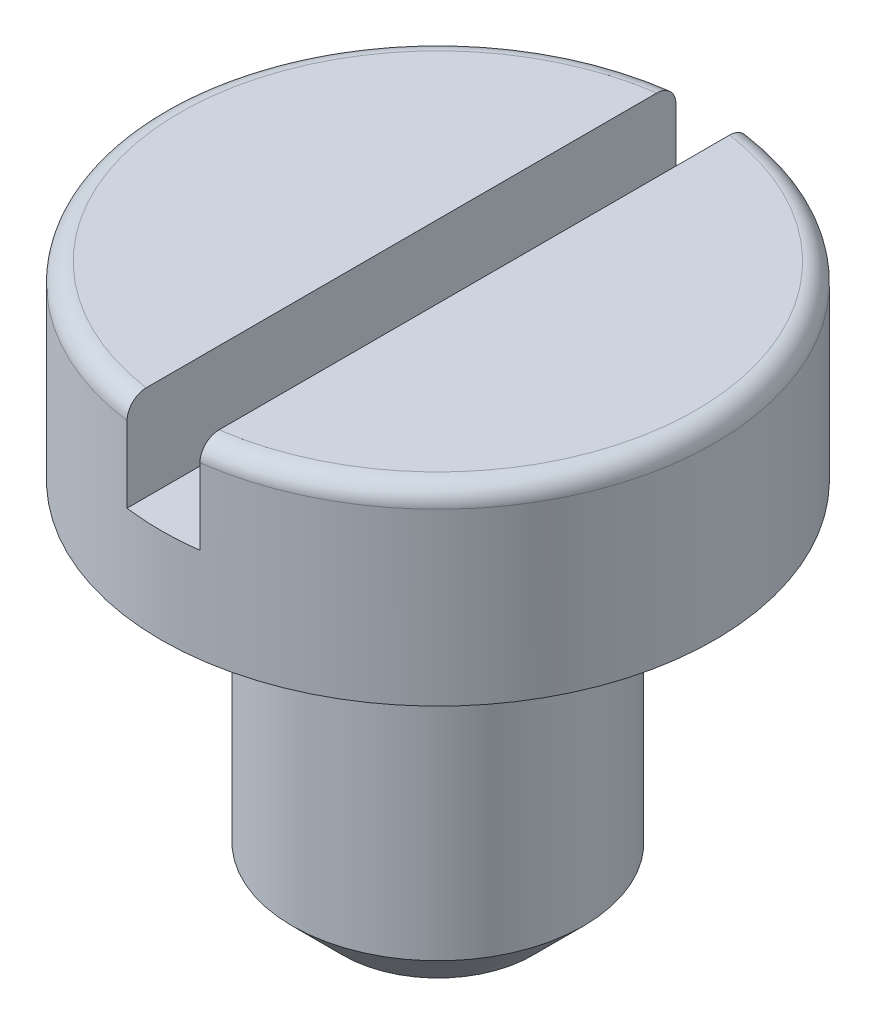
ISO-10303-21;
HEADER;
FILE_DESCRIPTION(('STEP AP214'),'2;1');
FILE_NAME('part.step','',(''),(''),'','','');
FILE_SCHEMA(('AUTOMOTIVE_DESIGN { 1 0 10303 214 1 1 1 1 }'));
ENDSEC;
DATA;
#1=APPLICATION_CONTEXT('core data for automotive mechanical design processes');
#2=APPLICATION_PROTOCOL_DEFINITION('international standard','automotive_design',2000,#1);
#3=PRODUCT_CONTEXT('',#1,'mechanical');
#4=PRODUCT('Part','Part','',(#3));
#5=PRODUCT_RELATED_PRODUCT_CATEGORY('part','',(#4));
#6=PRODUCT_DEFINITION_FORMATION('','',#4);
#7=PRODUCT_DEFINITION_CONTEXT('part definition',#1,'design');
#8=PRODUCT_DEFINITION('design','',#6,#7);
#9=PRODUCT_DEFINITION_SHAPE('','',#8);
#10=(LENGTH_UNIT() NAMED_UNIT(*) SI_UNIT(.MILLI.,.METRE.));
#11=(NAMED_UNIT(*) PLANE_ANGLE_UNIT() SI_UNIT($,.RADIAN.));
#12=(NAMED_UNIT(*) SI_UNIT($,.STERADIAN.) SOLID_ANGLE_UNIT());
#13=UNCERTAINTY_MEASURE_WITH_UNIT(LENGTH_MEASURE(1.E-05),#10,'distance_accuracy_value','');
#14=(GEOMETRIC_REPRESENTATION_CONTEXT(3) GLOBAL_UNCERTAINTY_ASSIGNED_CONTEXT((#13)) GLOBAL_UNIT_ASSIGNED_CONTEXT((#10,
#11,#12)) REPRESENTATION_CONTEXT('',''));
#15=CARTESIAN_POINT('',(0.,0.,0.));
#16=DIRECTION('',(0.,0.,1.));
#17=DIRECTION('',(1.,0.,0.));
#18=AXIS2_PLACEMENT_3D('',#15,#16,#17);
#19=CARTESIAN_POINT('',(0.,1.3,0.));
#20=DIRECTION('',(0.,-1.,0.));
#21=DIRECTION('',(0.,0.,-1.));
#22=AXIS2_PLACEMENT_3D('',#19,#20,#21);
#23=PLANE('',#22);
#24=CARTESIAN_POINT('',(0.,1.3,0.));
#25=DIRECTION('',(0.,1.,0.));
#26=DIRECTION('',(0.,0.,1.));
#27=AXIS2_PLACEMENT_3D('',#24,#25,#26);
#28=CIRCLE('',#27,1.77);
#29=CARTESIAN_POINT('',(-0.25,1.3,-1.75225568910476));
#30=VERTEX_POINT('',#29);
#31=CARTESIAN_POINT('',(-0.25,1.3,1.75225568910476));
#32=VERTEX_POINT('',#31);
#33=EDGE_CURVE('E96',#30,#32,#28,.T.);
#34=ORIENTED_EDGE('',*,*,#33,.T.);
#35=DIRECTION('',(0.,0.,1.));
#36=VECTOR('',#35,1.);
#37=CARTESIAN_POINT('',(-0.25,1.3,-1.9));
#38=LINE('',#37,#36);
#39=EDGE_CURVE('E87',#30,#32,#38,.T.);
#40=ORIENTED_EDGE('',*,*,#39,.F.);
#41=EDGE_LOOP('',(#34,#40));
#42=FACE_BOUND('',#41,.T.);
#43=ADVANCED_FACE('F33',(#42),#23,.F.);
#44=CARTESIAN_POINT('',(0.,1.17,0.));
#45=DIRECTION('',(0.,1.,0.));
#46=DIRECTION('',(0.,0.,1.));
#47=AXIS2_PLACEMENT_3D('',#44,#45,#46);
#48=TOROIDAL_SURFACE('',#47,1.77,0.13);
#49=ORIENTED_EDGE('',*,*,#33,.F.);
#50=CARTESIAN_POINT('',(-0.25,1.24765306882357,-1.85751121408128));
#51=CARTESIAN_POINT('',(-0.25,1.24184344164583,-1.8618768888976));
#52=CARTESIAN_POINT('',(-0.25,1.23566300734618,-1.8657574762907));
#53=CARTESIAN_POINT('',(-0.25,1.22273394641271,-1.87243030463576));
#54=CARTESIAN_POINT('',(-0.25,1.21598469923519,-1.87522133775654));
#55=CARTESIAN_POINT('',(-0.25,1.2021137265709,-1.8796278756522));
#56=CARTESIAN_POINT('',(-0.25,1.19499208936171,-1.88124365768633));
#57=CARTESIAN_POINT('',(-0.25,1.1805801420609,-1.88325159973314));
#58=CARTESIAN_POINT('',(-0.25,1.17328987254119,-1.88364405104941));
#59=CARTESIAN_POINT('',(-0.25,1.15877115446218,-1.88319529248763));
#60=CARTESIAN_POINT('',(-0.25,1.15154258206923,-1.88235808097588));
#61=CARTESIAN_POINT('',(-0.25,1.13732842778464,-1.87948214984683));
#62=CARTESIAN_POINT('',(-0.25,1.1303428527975,-1.87744339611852));
#63=CARTESIAN_POINT('',(-0.25,1.11681018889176,-1.87222403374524));
#64=CARTESIAN_POINT('',(-0.25,1.11026321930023,-1.86904311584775));
#65=CARTESIAN_POINT('',(-0.25,1.09779247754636,-1.86163282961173));
#66=CARTESIAN_POINT('',(-0.25,1.09186871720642,-1.85740344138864));
#67=CARTESIAN_POINT('',(-0.25,1.0807778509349,-1.84799363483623));
#68=CARTESIAN_POINT('',(-0.25,1.07561492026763,-1.84280829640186));
#69=CARTESIAN_POINT('',(-0.25,1.06622404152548,-1.83165084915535));
#70=CARTESIAN_POINT('',(-0.25,1.06199613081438,-1.82567870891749));
#71=CARTESIAN_POINT('',(-0.25,1.05455679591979,-1.81306325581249));
#72=CARTESIAN_POINT('',(-0.25,1.05135429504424,-1.80641468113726));
#73=CARTESIAN_POINT('',(-0.25,1.04610013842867,-1.79267739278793));
#74=CARTESIAN_POINT('',(-0.25,1.04404853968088,-1.78558865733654));
#75=CARTESIAN_POINT('',(-0.25,1.04113716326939,-1.77110723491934));
#76=CARTESIAN_POINT('',(-0.25,1.04028774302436,-1.76371246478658));
#77=CARTESIAN_POINT('',(-0.25,1.03983551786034,-1.74888481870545));
#78=CARTESIAN_POINT('',(-0.25,1.04023275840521,-1.74145194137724));
#79=CARTESIAN_POINT('',(-0.25,1.0422677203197,-1.72671918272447));
#80=CARTESIAN_POINT('',(-0.25,1.04391174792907,-1.71942017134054));
#81=CARTESIAN_POINT('',(-0.25,1.0484030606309,-1.70520204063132));
#82=CARTESIAN_POINT('',(-0.25,1.05125035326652,-1.69828292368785));
#83=CARTESIAN_POINT('',(-0.25,1.05806707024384,-1.68503083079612));
#84=CARTESIAN_POINT('',(-0.25,1.06203525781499,-1.67869721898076));
#85=CARTESIAN_POINT('',(-0.25,1.07098623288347,-1.66679261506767));
#86=CARTESIAN_POINT('',(-0.25,1.07596898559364,-1.66122159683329));
#87=CARTESIAN_POINT('',(-0.25,1.08676870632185,-1.65104713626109));
#88=CARTESIAN_POINT('',(-0.25,1.09257906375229,-1.64643667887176));
#89=CARTESIAN_POINT('',(-0.25,1.104898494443,-1.6382695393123));
#90=CARTESIAN_POINT('',(-0.25,1.11140752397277,-1.63471279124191));
#91=CARTESIAN_POINT('',(-0.25,1.12486287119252,-1.62879525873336));
#92=CARTESIAN_POINT('',(-0.25,1.13180360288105,-1.6264217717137));
#93=CARTESIAN_POINT('',(-0.25,1.14598688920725,-1.62288559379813));
#94=CARTESIAN_POINT('',(-0.25,1.15322942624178,-1.62172283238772));
#95=CARTESIAN_POINT('',(-0.25,1.1677414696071,-1.62064893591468));
#96=CARTESIAN_POINT('',(-0.25,1.17501015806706,-1.62072672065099));
#97=CARTESIAN_POINT('',(-0.25,1.18943061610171,-1.62210442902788));
#98=CARTESIAN_POINT('',(-0.25,1.19658238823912,-1.6234043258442));
#99=CARTESIAN_POINT('',(-0.25,1.21055111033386,-1.62718250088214));
#100=CARTESIAN_POINT('',(-0.25,1.2173687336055,-1.62965829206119));
#101=CARTESIAN_POINT('',(-0.25,1.23049498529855,-1.63571289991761));
#102=CARTESIAN_POINT('',(-0.25,1.23680360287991,-1.6392917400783));
#103=CARTESIAN_POINT('',(-0.25,1.24877339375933,-1.6474708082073));
#104=CARTESIAN_POINT('',(-0.25,1.25443060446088,-1.6520768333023));
#105=CARTESIAN_POINT('',(-0.25,1.26490155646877,-1.66216425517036));
#106=CARTESIAN_POINT('',(-0.25,1.2697152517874,-1.66764569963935));
#107=CARTESIAN_POINT('',(-0.25,1.27841666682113,-1.6793899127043));
#108=CARTESIAN_POINT('',(-0.25,1.28229410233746,-1.68566030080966));
#109=CARTESIAN_POINT('',(-0.25,1.28895337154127,-1.69875810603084));
#110=CARTESIAN_POINT('',(-0.25,1.29173514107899,-1.70558555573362));
#111=CARTESIAN_POINT('',(-0.25,1.29615144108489,-1.71967698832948));
#112=CARTESIAN_POINT('',(-0.25,1.29777424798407,-1.72694464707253));
#113=CARTESIAN_POINT('',(-0.25,1.29978331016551,-1.74164873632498));
#114=CARTESIAN_POINT('',(-0.25,1.30016956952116,-1.74908516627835));
#115=CARTESIAN_POINT('',(-0.25,1.29969333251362,-1.76395385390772));
#116=CARTESIAN_POINT('',(-0.25,1.29882483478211,-1.77138592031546));
#117=CARTESIAN_POINT('',(-0.25,1.29584988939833,-1.78600027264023));
#118=CARTESIAN_POINT('',(-0.25,1.29374313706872,-1.79318249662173));
#119=CARTESIAN_POINT('',(-0.25,1.28835198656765,-1.80707897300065));
#120=CARTESIAN_POINT('',(-0.25,1.2850691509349,-1.81379383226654));
#121=CARTESIAN_POINT('',(-0.25,1.27741685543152,-1.82656548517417));
#122=CARTESIAN_POINT('',(-0.25,1.27304873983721,-1.83262307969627));
#123=CARTESIAN_POINT('',(-0.25,1.26513647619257,-1.84182930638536));
#124=CARTESIAN_POINT('',(-0.25,1.2618794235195,-1.84522889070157));
#125=CARTESIAN_POINT('',(-0.25,1.25501770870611,-1.85165711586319));
#126=CARTESIAN_POINT('',(-0.25,1.25141304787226,-1.85468575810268));
#127=CARTESIAN_POINT('',(-0.25,1.24765306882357,-1.85751121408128));
#128=B_SPLINE_CURVE_WITH_KNOTS('',3,(#50,#51,#52,#53,#54,#55,#56,#57,#58,#59,#60,#61,#62,#63,
#64,#65,#66,#67,#68,#69,#70,#71,#72,#73,#74,#75,#76,#77,#78,#79,#80,#81,#82,#83,#84,#85,#86,#87,
#88,#89,#90,#91,#92,#93,#94,#95,#96,#97,#98,#99,#100,#101,#102,#103,#104,#105,#106,#107,#108,
#109,#110,#111,#112,#113,#114,#115,#116,#117,#118,#119,#120,#121,#122,#123,#124,#125,#126,#127),
.UNSPECIFIED.,.T.,.F.,(4,2,2,2,2,2,2,2,2,2,2,2,2,2,2,2,2,2,2,2,2,2,2,2,2,2,2,2,2,2,2,2,2,2,2,2,
2,2,4),(0.,0.0217843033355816,0.043592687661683,0.0653959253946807,0.0871939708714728,
0.10892129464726,0.130649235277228,0.152383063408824,0.174117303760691,0.1959666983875,
0.217816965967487,0.239852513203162,0.261889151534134,0.284114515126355,0.306340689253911,
0.328680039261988,0.351019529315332,0.373334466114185,0.395648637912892,0.417793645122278,
0.439937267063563,0.461837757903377,0.483736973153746,0.505440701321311,0.52714395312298,
0.548801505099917,0.570459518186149,0.592243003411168,0.614027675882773,0.636041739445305,
0.6580570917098,0.680292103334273,0.70252704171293,0.724868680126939,0.747215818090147,
0.769533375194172,0.791823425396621,0.805922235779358,0.820020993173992),.UNSPECIFIED.);
#129=CARTESIAN_POINT('',(-0.25,1.17,-1.88348082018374));
#130=VERTEX_POINT('',#129);
#131=EDGE_CURVE('E84',#30,#130,#128,.T.);
#132=ORIENTED_EDGE('',*,*,#131,.T.);
#133=CARTESIAN_POINT('',(0.,1.17,0.));
#134=DIRECTION('',(0.,1.,0.));
#135=DIRECTION('',(0.,0.,1.));
#136=AXIS2_PLACEMENT_3D('',#133,#134,#135);
#137=CIRCLE('',#136,1.9);
#138=CARTESIAN_POINT('',(-0.25,1.1700000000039,1.88348082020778));
#139=VERTEX_POINT('',#138);
#140=EDGE_CURVE('E103',#130,#139,#137,.T.);
#141=ORIENTED_EDGE('',*,*,#140,.T.);
#142=CARTESIAN_POINT('',(-0.25,1.22217563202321,1.63189133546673));
#143=CARTESIAN_POINT('',(-0.25,1.2155662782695,1.62896172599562));
#144=CARTESIAN_POINT('',(-0.25,1.20870599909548,1.62658586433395));
#145=CARTESIAN_POINT('',(-0.25,1.19467859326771,1.62301741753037));
#146=CARTESIAN_POINT('',(-0.25,1.18751113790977,1.62182613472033));
#147=CARTESIAN_POINT('',(-0.25,1.17307959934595,1.62066638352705));
#148=CARTESIAN_POINT('',(-0.25,1.1658155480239,1.62069752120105));
#149=CARTESIAN_POINT('',(-0.25,1.15139804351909,1.62198096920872));
#150=CARTESIAN_POINT('',(-0.25,1.14424456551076,1.62323300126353));
#151=CARTESIAN_POINT('',(-0.25,1.13025803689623,1.6269171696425));
#152=CARTESIAN_POINT('',(-0.25,1.12342459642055,1.62934782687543));
#153=CARTESIAN_POINT('',(-0.25,1.11025927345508,1.63531568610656));
#154=CARTESIAN_POINT('',(-0.25,1.10392741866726,1.63885294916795));
#155=CARTESIAN_POINT('',(-0.25,1.09190547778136,1.64695263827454));
#156=CARTESIAN_POINT('',(-0.25,1.08621921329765,1.65152073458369));
#157=CARTESIAN_POINT('',(-0.25,1.0756843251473,1.66153767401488));
#158=CARTESIAN_POINT('',(-0.25,1.07083574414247,1.66698656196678));
#159=CARTESIAN_POINT('',(-0.25,1.06205947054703,1.67867133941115));
#160=CARTESIAN_POINT('',(-0.25,1.05814197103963,1.68491488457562));
#161=CARTESIAN_POINT('',(-0.25,1.05139861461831,1.69796597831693));
#162=CARTESIAN_POINT('',(-0.25,1.04857281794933,1.70477355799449));
#163=CARTESIAN_POINT('',(-0.25,1.04406508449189,1.71883292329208));
#164=CARTESIAN_POINT('',(-0.25,1.04239489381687,1.72608847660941));
#165=CARTESIAN_POINT('',(-0.25,1.04028946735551,1.74077670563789));
#166=CARTESIAN_POINT('',(-0.25,1.03985427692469,1.74820938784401));
#167=CARTESIAN_POINT('',(-0.25,1.04023233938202,1.76308057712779));
#168=CARTESIAN_POINT('',(-0.25,1.04105188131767,1.77051892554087));
#169=CARTESIAN_POINT('',(-0.25,1.04393013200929,1.78515204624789));
#170=CARTESIAN_POINT('',(-0.25,1.04598884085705,1.7923468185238));
#171=CARTESIAN_POINT('',(-0.25,1.05128606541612,1.80627452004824));
#172=CARTESIAN_POINT('',(-0.25,1.0545226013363,1.81300820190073));
#173=CARTESIAN_POINT('',(-0.25,1.06208789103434,1.82583137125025));
#174=CARTESIAN_POINT('',(-0.25,1.06641660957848,1.83192087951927));
#175=CARTESIAN_POINT('',(-0.25,1.07601197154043,1.84323633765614));
#176=CARTESIAN_POINT('',(-0.25,1.081271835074,1.84846803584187));
#177=CARTESIAN_POINT('',(-0.25,1.09260224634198,1.85796431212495));
#178=CARTESIAN_POINT('',(-0.25,1.09867275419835,1.8622289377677));
#179=CARTESIAN_POINT('',(-0.25,1.1113932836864,1.86962939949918));
#180=CARTESIAN_POINT('',(-0.25,1.11803758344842,1.87277507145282));
#181=CARTESIAN_POINT('',(-0.25,1.1317626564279,1.87789675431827));
#182=CARTESIAN_POINT('',(-0.25,1.13884340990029,1.87987281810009));
#183=CARTESIAN_POINT('',(-0.25,1.15318400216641,1.88258559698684));
#184=CARTESIAN_POINT('',(-0.25,1.16044212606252,1.88333138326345));
#185=CARTESIAN_POINT('',(-0.25,1.17498019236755,1.8835896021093));
#186=CARTESIAN_POINT('',(-0.25,1.18226013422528,1.88310206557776));
#187=CARTESIAN_POINT('',(-0.25,1.19661137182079,1.88091174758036));
#188=CARTESIAN_POINT('',(-0.25,1.20368324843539,1.87921276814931));
#189=CARTESIAN_POINT('',(-0.25,1.21744230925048,1.87465415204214));
#190=CARTESIAN_POINT('',(-0.25,1.22412949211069,1.87179451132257));
#191=CARTESIAN_POINT('',(-0.25,1.23694611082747,1.86499113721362));
#192=CARTESIAN_POINT('',(-0.25,1.24307429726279,1.86104505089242));
#193=CARTESIAN_POINT('',(-0.25,1.25458685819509,1.85218647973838));
#194=CARTESIAN_POINT('',(-0.25,1.25997121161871,1.84727396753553));
#195=CARTESIAN_POINT('',(-0.25,1.26988286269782,1.83658758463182));
#196=CARTESIAN_POINT('',(-0.25,1.27440415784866,1.83080814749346));
#197=CARTESIAN_POINT('',(-0.25,1.28242241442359,1.81857781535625));
#198=CARTESIAN_POINT('',(-0.25,1.28591932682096,1.81212688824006));
#199=CARTESIAN_POINT('',(-0.25,1.29182246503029,1.79867523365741));
#200=CARTESIAN_POINT('',(-0.25,1.29421869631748,1.79167012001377));
#201=CARTESIAN_POINT('',(-0.25,1.29781120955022,1.77735865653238));
#202=CARTESIAN_POINT('',(-0.25,1.29900743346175,1.77005229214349));
#203=CARTESIAN_POINT('',(-0.25,1.30017372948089,1.75528528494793));
#204=CARTESIAN_POINT('',(-0.25,1.30013423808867,1.74782388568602));
#205=CARTESIAN_POINT('',(-0.25,1.29880740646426,1.73301302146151));
#206=CARTESIAN_POINT('',(-0.25,1.29752007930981,1.72566355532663));
#207=CARTESIAN_POINT('',(-0.25,1.29372696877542,1.71126230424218));
#208=CARTESIAN_POINT('',(-0.25,1.29121754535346,1.70421147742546));
#209=CARTESIAN_POINT('',(-0.25,1.28504573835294,1.69063136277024));
#210=CARTESIAN_POINT('',(-0.25,1.28138307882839,1.68410220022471));
#211=CARTESIAN_POINT('',(-0.25,1.27301908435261,1.67177695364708));
#212=CARTESIAN_POINT('',(-0.25,1.26832097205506,1.66597868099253));
#213=CARTESIAN_POINT('',(-0.25,1.25801286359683,1.65526810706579));
#214=CARTESIAN_POINT('',(-0.25,1.25240401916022,1.65035470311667));
#215=CARTESIAN_POINT('',(-0.25,1.24264953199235,1.64318421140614));
#216=CARTESIAN_POINT('',(-0.25,1.238728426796,1.64061623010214));
#217=CARTESIAN_POINT('',(-0.25,1.23063184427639,1.6359185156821));
#218=CARTESIAN_POINT('',(-0.25,1.2264563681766,1.63378878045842));
#219=CARTESIAN_POINT('',(-0.25,1.22217563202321,1.63189133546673));
#220=B_SPLINE_CURVE_WITH_KNOTS('',3,(#142,#143,#144,#145,#146,#147,#148,#149,#150,#151,#152,
#153,#154,#155,#156,#157,#158,#159,#160,#161,#162,#163,#164,#165,#166,#167,#168,#169,#170,#171,
#172,#173,#174,#175,#176,#177,#178,#179,#180,#181,#182,#183,#184,#185,#186,#187,#188,#189,#190,
#191,#192,#193,#194,#195,#196,#197,#198,#199,#200,#201,#202,#203,#204,#205,#206,#207,#208,#209,
#210,#211,#212,#213,#214,#215,#216,#217,#218,#219),.UNSPECIFIED.,.T.,.F.,(4,2,2,2,2,2,2,2,2,2,2,
2,2,2,2,2,2,2,2,2,2,2,2,2,2,2,2,2,2,2,2,2,2,2,2,2,2,2,4),(0.,0.0216716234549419,
0.043367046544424,0.0650554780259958,0.0867389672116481,0.108395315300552,0.130052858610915,
0.151832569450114,0.173613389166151,0.195622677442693,0.217633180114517,0.239864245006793,
0.262096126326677,0.284439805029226,0.306783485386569,0.329089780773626,0.351395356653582,
0.373544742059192,0.395693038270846,0.417641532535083,0.439589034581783,0.461373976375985,
0.483158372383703,0.50487469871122,0.526591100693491,0.5483549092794,0.570119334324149,
0.592030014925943,0.613941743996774,0.636048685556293,0.658156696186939,0.680435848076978,
0.702714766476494,0.725060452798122,0.747411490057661,0.769693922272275,0.791948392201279,
0.805984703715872,0.820020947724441),.UNSPECIFIED.);
#221=EDGE_CURVE('E93',#139,#32,#220,.T.);
#222=ORIENTED_EDGE('',*,*,#221,.T.);
#223=EDGE_LOOP('',(#49,#132,#141,#222));
#224=FACE_BOUND('',#223,.T.);
#225=ADVANCED_FACE('F99',(#224),#48,.T.);
#226=CARTESIAN_POINT('',(0.,-2.5,0.));
#227=DIRECTION('',(0.,1.,0.));
#228=DIRECTION('',(0.,0.,1.));
#229=AXIS2_PLACEMENT_3D('',#226,#227,#228);
#230=CYLINDRICAL_SURFACE('',#229,1.);
#231=CARTESIAN_POINT('',(0.,-2.14999999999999,0.));
#232=DIRECTION('',(0.,1.,0.));
#233=DIRECTION('',(0.,0.,1.));
#234=AXIS2_PLACEMENT_3D('',#231,#232,#233);
#235=CIRCLE('',#234,1.);
#236=CARTESIAN_POINT('',(0.,-2.14999999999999,1.));
#237=VERTEX_POINT('',#236);
#238=EDGE_CURVE('E116',#237,#237,#235,.T.);
#239=ORIENTED_EDGE('',*,*,#238,.T.);
#240=EDGE_LOOP('',(#239));
#241=FACE_BOUND('',#240,.T.);
#242=CARTESIAN_POINT('',(0.,0.,0.));
#243=DIRECTION('',(0.,1.,0.));
#244=DIRECTION('',(0.,0.,1.));
#245=AXIS2_PLACEMENT_3D('',#242,#243,#244);
#246=CIRCLE('',#245,1.);
#247=CARTESIAN_POINT('',(0.,0.,1.));
#248=VERTEX_POINT('',#247);
#249=EDGE_CURVE('E113',#248,#248,#246,.T.);
#250=ORIENTED_EDGE('',*,*,#249,.F.);
#251=EDGE_LOOP('',(#250));
#252=FACE_BOUND('',#251,.T.);
#253=ADVANCED_FACE('F184',(#241,#252),#230,.T.);
#254=CARTESIAN_POINT('',(0.,-2.5,0.));
#255=DIRECTION('',(0.,1.,0.));
#256=DIRECTION('',(0.,0.,1.));
#257=AXIS2_PLACEMENT_3D('',#254,#255,#256);
#258=PLANE('',#257);
#259=CARTESIAN_POINT('',(0.,-2.5,0.));
#260=DIRECTION('',(0.,1.,0.));
#261=DIRECTION('',(0.,0.,1.));
#262=AXIS2_PLACEMENT_3D('',#259,#260,#261);
#263=CIRCLE('',#262,0.649999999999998);
#264=CARTESIAN_POINT('',(0.,-2.5,0.649999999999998));
#265=VERTEX_POINT('',#264);
#266=EDGE_CURVE('E119',#265,#265,#263,.F.);
#267=ORIENTED_EDGE('',*,*,#266,.T.);
#268=EDGE_LOOP('',(#267));
#269=FACE_BOUND('',#268,.T.);
#270=ADVANCED_FACE('F194',(#269),#258,.F.);
#271=CARTESIAN_POINT('',(0.,-2.14999999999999,0.));
#272=DIRECTION('',(0.,1.,0.));
#273=DIRECTION('',(0.,0.,1.));
#274=AXIS2_PLACEMENT_3D('',#271,#272,#273);
#275=CONICAL_SURFACE('',#274,1.,0.785398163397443);
#276=ORIENTED_EDGE('',*,*,#266,.F.);
#277=EDGE_LOOP('',(#276));
#278=FACE_BOUND('',#277,.T.);
#279=ORIENTED_EDGE('',*,*,#238,.F.);
#280=EDGE_LOOP('',(#279));
#281=FACE_BOUND('',#280,.T.);
#282=ADVANCED_FACE('F35',(#278,#281),#275,.T.);
#283=CARTESIAN_POINT('',(0.25,1.3,1.75225568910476));
#284=VERTEX_POINT('',#283);
#285=CARTESIAN_POINT('',(0.25,1.3,-1.75225568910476));
#286=VERTEX_POINT('',#285);
#287=EDGE_CURVE('E100',#284,#286,#28,.T.);
#288=ORIENTED_EDGE('',*,*,#287,.T.);
#289=DIRECTION('',(0.,0.,-1.));
#290=VECTOR('',#289,1.);
#291=CARTESIAN_POINT('',(0.25,1.3,-1.9));
#292=LINE('',#291,#290);
#293=EDGE_CURVE('E97',#284,#286,#292,.T.);
#294=ORIENTED_EDGE('',*,*,#293,.F.);
#295=EDGE_LOOP('',(#288,#294));
#296=FACE_BOUND('',#295,.T.);
#297=ADVANCED_FACE('F158',(#296),#23,.F.);
#298=CARTESIAN_POINT('',(0.,0.,0.));
#299=DIRECTION('',(0.,1.,0.));
#300=DIRECTION('',(0.,0.,1.));
#301=AXIS2_PLACEMENT_3D('',#298,#299,#300);
#302=PLANE('',#301);
#303=ORIENTED_EDGE('',*,*,#249,.T.);
#304=EDGE_LOOP('',(#303));
#305=FACE_BOUND('',#304,.T.);
#306=CARTESIAN_POINT('',(0.,0.,0.));
#307=DIRECTION('',(0.,1.,0.));
#308=DIRECTION('',(0.,0.,1.));
#309=AXIS2_PLACEMENT_3D('',#306,#307,#308);
#310=CIRCLE('',#309,1.9);
#311=CARTESIAN_POINT('',(0.,0.,1.9));
#312=VERTEX_POINT('',#311);
#313=EDGE_CURVE('E110',#312,#312,#310,.T.);
#314=ORIENTED_EDGE('',*,*,#313,.F.);
#315=EDGE_LOOP('',(#314));
#316=FACE_BOUND('',#315,.T.);
#317=ADVANCED_FACE('F188',(#305,#316),#302,.F.);
#318=CARTESIAN_POINT('',(0.,1.3,0.));
#319=DIRECTION('',(0.,1.,0.));
#320=DIRECTION('',(0.,0.,1.));
#321=AXIS2_PLACEMENT_3D('',#318,#319,#320);
#322=CYLINDRICAL_SURFACE('',#321,1.9);
#323=ORIENTED_EDGE('',*,*,#140,.F.);
#324=DIRECTION('',(0.,1.,0.));
#325=VECTOR('',#324,1.);
#326=CARTESIAN_POINT('',(-0.25,1.3,-1.88348082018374));
#327=LINE('',#326,#325);
#328=CARTESIAN_POINT('',(-0.25,0.65,-1.88348082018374));
#329=VERTEX_POINT('',#328);
#330=EDGE_CURVE('E56',#130,#329,#327,.F.);
#331=ORIENTED_EDGE('',*,*,#330,.T.);
#332=CARTESIAN_POINT('',(0.,0.65,0.));
#333=DIRECTION('',(0.,1.,0.));
#334=DIRECTION('',(0.,0.,1.));
#335=AXIS2_PLACEMENT_3D('',#332,#333,#334);
#336=CIRCLE('',#335,1.9);
#337=CARTESIAN_POINT('',(0.25,0.65,-1.88348082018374));
#338=VERTEX_POINT('',#337);
#339=EDGE_CURVE('E11',#338,#329,#336,.T.);
#340=ORIENTED_EDGE('',*,*,#339,.F.);
#341=DIRECTION('',(0.,1.,0.));
#342=VECTOR('',#341,1.);
#343=CARTESIAN_POINT('',(0.25,1.3,-1.88348082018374));
#344=LINE('',#343,#342);
#345=CARTESIAN_POINT('',(0.25,1.17000000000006,-1.88348082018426));
#346=VERTEX_POINT('',#345);
#347=EDGE_CURVE('E167',#338,#346,#344,.T.);
#348=ORIENTED_EDGE('',*,*,#347,.T.);
#349=CARTESIAN_POINT('',(0.25,1.17,1.88348082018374));
#350=VERTEX_POINT('',#349);
#351=EDGE_CURVE('E109',#350,#346,#137,.T.);
#352=ORIENTED_EDGE('',*,*,#351,.F.);
#353=DIRECTION('',(0.,1.,0.));
#354=VECTOR('',#353,1.);
#355=CARTESIAN_POINT('',(0.25,1.3,1.88348082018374));
#356=LINE('',#355,#354);
#357=CARTESIAN_POINT('',(0.25,0.65,1.88348082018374));
#358=VERTEX_POINT('',#357);
#359=EDGE_CURVE('E48',#350,#358,#356,.F.);
#360=ORIENTED_EDGE('',*,*,#359,.T.);
#361=CARTESIAN_POINT('',(-0.25,0.65,1.88348082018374));
#362=VERTEX_POINT('',#361);
#363=EDGE_CURVE('E37',#362,#358,#336,.T.);
#364=ORIENTED_EDGE('',*,*,#363,.F.);
#365=DIRECTION('',(0.,1.,0.));
#366=VECTOR('',#365,1.);
#367=CARTESIAN_POINT('',(-0.25,1.3,1.88348082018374));
#368=LINE('',#367,#366);
#369=EDGE_CURVE('E104',#362,#139,#368,.T.);
#370=ORIENTED_EDGE('',*,*,#369,.T.);
#371=EDGE_LOOP('',(#323,#331,#340,#348,#352,#360,#364,#370));
#372=FACE_BOUND('',#371,.T.);
#373=ORIENTED_EDGE('',*,*,#313,.T.);
#374=EDGE_LOOP('',(#373));
#375=FACE_BOUND('',#374,.T.);
#376=ADVANCED_FACE('F171',(#372,#375),#322,.T.);
#377=ORIENTED_EDGE('',*,*,#351,.T.);
#378=CARTESIAN_POINT('',(0.25,1.24765306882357,-1.85751121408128));
#379=CARTESIAN_POINT('',(0.25,1.2535323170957,-1.85309239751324));
#380=CARTESIAN_POINT('',(0.25,1.25904032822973,-1.84817022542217));
#381=CARTESIAN_POINT('',(0.25,1.2691540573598,-1.8374648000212));
#382=CARTESIAN_POINT('',(0.25,1.27375858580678,-1.83168042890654));
#383=CARTESIAN_POINT('',(0.25,1.28192985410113,-1.81942676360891));
#384=CARTESIAN_POINT('',(0.25,1.28549748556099,-1.81295806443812));
#385=CARTESIAN_POINT('',(0.25,1.29150306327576,-1.79951842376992));
#386=CARTESIAN_POINT('',(0.25,1.29394128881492,-1.79254760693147));
#387=CARTESIAN_POINT('',(0.25,1.29763786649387,-1.77825097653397));
#388=CARTESIAN_POINT('',(0.25,1.29888837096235,-1.77092313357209));
#389=CARTESIAN_POINT('',(0.25,1.3001493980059,-1.75616113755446));
#390=CARTESIAN_POINT('',(0.25,1.30015981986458,-1.74872697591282));
#391=CARTESIAN_POINT('',(0.25,1.29893752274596,-1.73391737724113));
#392=CARTESIAN_POINT('',(0.25,1.2976974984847,-1.72654254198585));
#393=CARTESIAN_POINT('',(0.25,1.29399712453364,-1.71210548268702));
#394=CARTESIAN_POINT('',(0.25,1.29153676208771,-1.70504326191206));
#395=CARTESIAN_POINT('',(0.25,1.28546235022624,-1.69143332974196));
#396=CARTESIAN_POINT('',(0.25,1.2818482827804,-1.68488562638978));
#397=CARTESIAN_POINT('',(0.25,1.27356523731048,-1.67249520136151));
#398=CARTESIAN_POINT('',(0.25,1.2688962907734,-1.66665245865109));
#399=CARTESIAN_POINT('',(0.25,1.25866740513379,-1.65588110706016));
#400=CARTESIAN_POINT('',(0.25,1.25311359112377,-1.65094668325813));
#401=CARTESIAN_POINT('',(0.25,1.24124864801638,-1.64209244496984));
#402=CARTESIAN_POINT('',(0.25,1.23493756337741,-1.63817257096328));
#403=CARTESIAN_POINT('',(0.25,1.221809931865,-1.63150376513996));
#404=CARTESIAN_POINT('',(0.25,1.21499955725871,-1.62874268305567));
#405=CARTESIAN_POINT('',(0.25,1.20100918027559,-1.62441574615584));
#406=CARTESIAN_POINT('',(0.25,1.19382920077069,-1.62284981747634));
#407=CARTESIAN_POINT('',(0.25,1.17937779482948,-1.62097087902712));
#408=CARTESIAN_POINT('',(0.25,1.17210791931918,-1.62064592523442));
#409=CARTESIAN_POINT('',(0.25,1.15761752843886,-1.62122580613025));
#410=CARTESIAN_POINT('',(0.25,1.15039701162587,-1.62213060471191));
#411=CARTESIAN_POINT('',(0.25,1.13623565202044,-1.62513698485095));
#412=CARTESIAN_POINT('',(0.25,1.12929393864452,-1.62723447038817));
#413=CARTESIAN_POINT('',(0.25,1.11585878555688,-1.63255985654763));
#414=CARTESIAN_POINT('',(0.25,1.10936535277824,-1.63578777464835));
#415=CARTESIAN_POINT('',(0.25,1.0969773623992,-1.64329576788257));
#416=CARTESIAN_POINT('',(0.25,1.09108571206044,-1.64758063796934));
#417=CARTESIAN_POINT('',(0.25,1.0800962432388,-1.65706952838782));
#418=CARTESIAN_POINT('',(0.25,1.07499846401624,-1.66227359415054));
#419=CARTESIAN_POINT('',(0.25,1.06568607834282,-1.67350893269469));
#420=CARTESIAN_POINT('',(0.25,1.06148091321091,-1.67954803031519));
#421=CARTESIAN_POINT('',(0.25,1.05413182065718,-1.69224064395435));
#422=CARTESIAN_POINT('',(0.25,1.05098795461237,-1.69889419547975));
#423=CARTESIAN_POINT('',(0.25,1.04581768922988,-1.71270143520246));
#424=CARTESIAN_POINT('',(0.25,1.0438032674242,-1.71985961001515));
#425=CARTESIAN_POINT('',(0.25,1.04099678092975,-1.7344117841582));
#426=CARTESIAN_POINT('',(0.25,1.04020476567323,-1.74180579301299));
#427=CARTESIAN_POINT('',(0.25,1.03986397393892,-1.75666650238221));
#428=CARTESIAN_POINT('',(0.25,1.0403225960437,-1.76413337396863));
#429=CARTESIAN_POINT('',(0.25,1.04248769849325,-1.7788841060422));
#430=CARTESIAN_POINT('',(0.25,1.04419418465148,-1.78616796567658));
#431=CARTESIAN_POINT('',(0.25,1.04880820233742,-1.80033913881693));
#432=CARTESIAN_POINT('',(0.25,1.05171485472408,-1.8072267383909));
#433=CARTESIAN_POINT('',(0.25,1.05865047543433,-1.82041177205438));
#434=CARTESIAN_POINT('',(0.25,1.06267941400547,-1.8267092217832));
#435=CARTESIAN_POINT('',(0.25,1.07171885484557,-1.83849095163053));
#436=CARTESIAN_POINT('',(0.25,1.07672289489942,-1.8439801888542));
#437=CARTESIAN_POINT('',(0.25,1.08758896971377,-1.85403127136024));
#438=CARTESIAN_POINT('',(0.25,1.0934509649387,-1.85859315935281));
#439=CARTESIAN_POINT('',(0.25,1.10581028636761,-1.86661667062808));
#440=CARTESIAN_POINT('',(0.25,1.11230146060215,-1.87008777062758));
#441=CARTESIAN_POINT('',(0.25,1.12577749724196,-1.87588085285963));
#442=CARTESIAN_POINT('',(0.25,1.13276231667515,-1.87820293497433));
#443=CARTESIAN_POINT('',(0.25,1.14696788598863,-1.88161455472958));
#444=CARTESIAN_POINT('',(0.25,1.15418632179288,-1.88271373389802));
#445=CARTESIAN_POINT('',(0.25,1.16870712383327,-1.88367959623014));
#446=CARTESIAN_POINT('',(0.25,1.17600950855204,-1.88354600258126));
#447=CARTESIAN_POINT('',(0.25,1.19046209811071,-1.88205268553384));
#448=CARTESIAN_POINT('',(0.25,1.19761273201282,-1.88069708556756));
#449=CARTESIAN_POINT('',(0.25,1.21157896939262,-1.87680635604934));
#450=CARTESIAN_POINT('',(0.25,1.21839497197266,-1.87427267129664));
#451=CARTESIAN_POINT('',(0.25,1.22895271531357,-1.8693056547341));
#452=CARTESIAN_POINT('',(0.25,1.23285989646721,-1.86721588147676));
#453=CARTESIAN_POINT('',(0.25,1.24044057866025,-1.86264860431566));
#454=CARTESIAN_POINT('',(0.25,1.24411408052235,-1.86017110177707));
#455=CARTESIAN_POINT('',(0.25,1.24765306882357,-1.85751121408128));
#456=B_SPLINE_CURVE_WITH_KNOTS('',3,(#378,#379,#380,#381,#382,#383,#384,#385,#386,#387,#388,
#389,#390,#391,#392,#393,#394,#395,#396,#397,#398,#399,#400,#401,#402,#403,#404,#405,#406,#407,
#408,#409,#410,#411,#412,#413,#414,#415,#416,#417,#418,#419,#420,#421,#422,#423,#424,#425,#426,
#427,#428,#429,#430,#431,#432,#433,#434,#435,#436,#437,#438,#439,#440,#441,#442,#443,#444,#445,
#446,#447,#448,#449,#450,#451,#452,#453,#454,#455),.UNSPECIFIED.,.T.,.F.,(4,2,2,2,2,2,2,2,2,2,2,
2,2,2,2,2,2,2,2,2,2,2,2,2,2,2,2,2,2,2,2,2,2,2,2,2,2,2,4),(0.,0.0220477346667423,
0.0441243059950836,0.0661818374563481,0.0882339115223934,0.110430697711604,0.132629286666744,
0.15495831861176,0.177287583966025,0.199617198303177,0.221946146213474,0.244126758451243,
0.266306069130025,0.288246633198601,0.310185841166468,0.331913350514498,0.353640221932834,
0.375292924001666,0.396945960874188,0.418699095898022,0.440453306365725,0.462427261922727,
0.484402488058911,0.50660655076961,0.528811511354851,0.551148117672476,0.573484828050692,
0.595805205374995,0.618124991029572,0.640301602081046,0.66247719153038,0.684454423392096,
0.706429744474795,0.728230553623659,0.75003625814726,0.771768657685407,0.793474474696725,
0.806746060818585,0.82001760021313),.UNSPECIFIED.);
#457=EDGE_CURVE('E128',#346,#286,#456,.T.);
#458=ORIENTED_EDGE('',*,*,#457,.T.);
#459=ORIENTED_EDGE('',*,*,#287,.F.);
#460=CARTESIAN_POINT('',(0.25,1.22217563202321,1.63189133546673));
#461=CARTESIAN_POINT('',(0.25,1.22886767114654,1.63485832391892));
#462=CARTESIAN_POINT('',(0.25,1.23531223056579,1.6383974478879));
#463=CARTESIAN_POINT('',(0.25,1.24751873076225,1.64651362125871));
#464=CARTESIAN_POINT('',(0.25,1.25327976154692,1.65109203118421));
#465=CARTESIAN_POINT('',(0.25,1.26394861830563,1.66114473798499));
#466=CARTESIAN_POINT('',(0.25,1.26885724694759,1.666618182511));
#467=CARTESIAN_POINT('',(0.25,1.27769326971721,1.67830402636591));
#468=CARTESIAN_POINT('',(0.25,1.28162090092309,1.68451624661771));
#469=CARTESIAN_POINT('',(0.25,1.28842015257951,1.69755830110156));
#470=CARTESIAN_POINT('',(0.25,1.29128294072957,1.70439274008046));
#471=CARTESIAN_POINT('',(0.25,1.29583101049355,1.7184431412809));
#472=CARTESIAN_POINT('',(0.25,1.2975161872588,1.72565913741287));
#473=CARTESIAN_POINT('',(0.25,1.29967231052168,1.74032942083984));
#474=CARTESIAN_POINT('',(0.25,1.30013344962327,1.74778515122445));
#475=CARTESIAN_POINT('',(0.25,1.29979998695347,1.76266860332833));
#476=CARTESIAN_POINT('',(0.25,1.29900536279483,1.7700963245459));
#477=CARTESIAN_POINT('',(0.25,1.29617810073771,1.78472604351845));
#478=CARTESIAN_POINT('',(0.25,1.29414329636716,1.79192762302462));
#479=CARTESIAN_POINT('',(0.25,1.28888801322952,1.80588449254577));
#480=CARTESIAN_POINT('',(0.25,1.28566755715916,1.81263979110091));
#481=CARTESIAN_POINT('',(0.25,1.27814634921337,1.82547779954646));
#482=CARTESIAN_POINT('',(0.25,1.27385065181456,1.83156346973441));
#483=CARTESIAN_POINT('',(0.25,1.264290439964,1.84291937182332));
#484=CARTESIAN_POINT('',(0.25,1.2590259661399,1.84818963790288));
#485=CARTESIAN_POINT('',(0.25,1.24772506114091,1.85771712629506));
#486=CARTESIAN_POINT('',(0.25,1.24169554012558,1.86198254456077));
#487=CARTESIAN_POINT('',(0.25,1.22900094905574,1.86943016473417));
#488=CARTESIAN_POINT('',(0.25,1.22233591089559,1.87261242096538));
#489=CARTESIAN_POINT('',(0.25,1.20862156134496,1.87777530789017));
#490=CARTESIAN_POINT('',(0.25,1.2015760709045,1.87976609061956));
#491=CARTESIAN_POINT('',(0.25,1.1872501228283,1.88252916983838));
#492=CARTESIAN_POINT('',(0.25,1.17996967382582,1.88330151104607));
#493=CARTESIAN_POINT('',(0.25,1.16542361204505,1.88360369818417));
#494=CARTESIAN_POINT('',(0.25,1.15815814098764,1.88314041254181));
#495=CARTESIAN_POINT('',(0.25,1.14380841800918,1.88099982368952));
#496=CARTESIAN_POINT('',(0.25,1.13672416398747,1.87932253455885));
#497=CARTESIAN_POINT('',(0.25,1.12294112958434,1.87480499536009));
#498=CARTESIAN_POINT('',(0.25,1.11624214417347,1.87196537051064));
#499=CARTESIAN_POINT('',(0.25,1.10341298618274,1.86520673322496));
#500=CARTESIAN_POINT('',(0.25,1.0972828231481,1.86128770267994));
#501=CARTESIAN_POINT('',(0.25,1.08573392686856,1.85246369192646));
#502=CARTESIAN_POINT('',(0.25,1.08031860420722,1.84755424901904));
#503=CARTESIAN_POINT('',(0.25,1.07038087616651,1.83690248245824));
#504=CARTESIAN_POINT('',(0.25,1.06585850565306,1.83116012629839));
#505=CARTESIAN_POINT('',(0.25,1.05779517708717,1.81895574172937));
#506=CARTESIAN_POINT('',(0.25,1.05426253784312,1.81248821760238));
#507=CARTESIAN_POINT('',(0.25,1.04832234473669,1.79905568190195));
#508=CARTESIAN_POINT('',(0.25,1.04591484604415,1.79209064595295));
#509=CARTESIAN_POINT('',(0.25,1.04227191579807,1.77779524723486));
#510=CARTESIAN_POINT('',(0.25,1.04104696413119,1.77046221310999));
#511=CARTESIAN_POINT('',(0.25,1.03983767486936,1.75569449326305));
#512=CARTESIAN_POINT('',(0.25,1.03985338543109,1.74825980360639));
#513=CARTESIAN_POINT('',(0.25,1.04112789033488,1.73345382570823));
#514=CARTESIAN_POINT('',(0.25,1.04239393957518,1.72608316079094));
#515=CARTESIAN_POINT('',(0.25,1.0461453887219,1.7116587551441));
#516=CARTESIAN_POINT('',(0.25,1.04863080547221,1.70460501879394));
#517=CARTESIAN_POINT('',(0.25,1.05475343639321,1.69101672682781));
#518=CARTESIAN_POINT('',(0.25,1.05839058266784,1.68448214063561));
#519=CARTESIAN_POINT('',(0.25,1.06671731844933,1.67212169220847));
#520=CARTESIAN_POINT('',(0.25,1.07140688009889,1.6662958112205));
#521=CARTESIAN_POINT('',(0.25,1.08167354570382,1.65556163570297));
#522=CARTESIAN_POINT('',(0.25,1.08724450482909,1.65064746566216));
#523=CARTESIAN_POINT('',(0.25,1.09913984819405,1.64183658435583));
#524=CARTESIAN_POINT('',(0.25,1.10546415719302,1.63793977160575));
#525=CARTESIAN_POINT('',(0.25,1.11861309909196,1.63131912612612));
#526=CARTESIAN_POINT('',(0.25,1.12543153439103,1.62858298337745));
#527=CARTESIAN_POINT('',(0.25,1.13943562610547,1.6243062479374));
#528=CARTESIAN_POINT('',(0.25,1.14662135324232,1.62276588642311));
#529=CARTESIAN_POINT('',(0.25,1.16108288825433,1.62093773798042));
#530=CARTESIAN_POINT('',(0.25,1.16835727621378,1.62063865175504));
#531=CARTESIAN_POINT('',(0.25,1.18284597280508,1.62127192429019));
#532=CARTESIAN_POINT('',(0.25,1.1900603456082,1.6222027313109));
#533=CARTESIAN_POINT('',(0.25,1.20143847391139,1.62465969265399));
#534=CARTESIAN_POINT('',(0.25,1.2056873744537,1.62580836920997));
#535=CARTESIAN_POINT('',(0.25,1.21404583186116,1.62853298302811));
#536=CARTESIAN_POINT('',(0.25,1.21815538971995,1.63010891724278));
#537=CARTESIAN_POINT('',(0.25,1.22217563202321,1.63189133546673));
#538=B_SPLINE_CURVE_WITH_KNOTS('',3,(#460,#461,#462,#463,#464,#465,#466,#467,#468,#469,#470,
#471,#472,#473,#474,#475,#476,#477,#478,#479,#480,#481,#482,#483,#484,#485,#486,#487,#488,#489,
#490,#491,#492,#493,#494,#495,#496,#497,#498,#499,#500,#501,#502,#503,#504,#505,#506,#507,#508,
#509,#510,#511,#512,#513,#514,#515,#516,#517,#518,#519,#520,#521,#522,#523,#524,#525,#526,#527,
#528,#529,#530,#531,#532,#533,#534,#535,#536,#537),.UNSPECIFIED.,.T.,.F.,(4,2,2,2,2,2,2,2,2,2,2,
2,2,2,2,2,2,2,2,2,2,2,2,2,2,2,2,2,2,2,2,2,2,2,2,2,2,2,4),(0.,0.0219445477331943,
0.0439179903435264,0.0658706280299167,0.0878179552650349,0.109943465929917,0.132070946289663,
0.154375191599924,0.176679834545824,0.199023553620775,0.221366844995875,0.243607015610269,
0.265846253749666,0.287897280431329,0.309947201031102,0.331806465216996,0.353664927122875,
0.375402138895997,0.397139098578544,0.418864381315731,0.44059002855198,0.462415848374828,
0.484242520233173,0.506247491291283,0.528253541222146,0.550452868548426,0.572653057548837,
0.594982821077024,0.617312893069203,0.639641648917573,0.661969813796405,0.684148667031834,
0.706325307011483,0.728260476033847,0.750199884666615,0.771939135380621,0.793650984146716,
0.806834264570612,0.820017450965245),.UNSPECIFIED.);
#539=EDGE_CURVE('E122',#284,#350,#538,.T.);
#540=ORIENTED_EDGE('',*,*,#539,.T.);
#541=EDGE_LOOP('',(#377,#458,#459,#540));
#542=FACE_BOUND('',#541,.T.);
#543=ADVANCED_FACE('F132',(#542),#48,.T.);
#544=CARTESIAN_POINT('',(-0.25,0.65,1.9));
#545=DIRECTION('',(0.,1.,0.));
#546=DIRECTION('',(0.,0.,1.));
#547=AXIS2_PLACEMENT_3D('',#544,#545,#546);
#548=PLANE('',#547);
#549=DIRECTION('',(0.,0.,-1.));
#550=VECTOR('',#549,1.);
#551=CARTESIAN_POINT('',(0.25,0.65,-1.9));
#552=LINE('',#551,#550);
#553=EDGE_CURVE('E162',#358,#338,#552,.T.);
#554=ORIENTED_EDGE('',*,*,#553,.T.);
#555=ORIENTED_EDGE('',*,*,#339,.T.);
#556=DIRECTION('',(0.,0.,1.));
#557=VECTOR('',#556,1.);
#558=CARTESIAN_POINT('',(-0.25,0.65,-1.9));
#559=LINE('',#558,#557);
#560=EDGE_CURVE('E159',#329,#362,#559,.T.);
#561=ORIENTED_EDGE('',*,*,#560,.T.);
#562=ORIENTED_EDGE('',*,*,#363,.T.);
#563=EDGE_LOOP('',(#554,#555,#561,#562));
#564=FACE_BOUND('',#563,.T.);
#565=ADVANCED_FACE('F140',(#564),#548,.T.);
#566=CARTESIAN_POINT('',(-0.25,0.65,-1.9));
#567=DIRECTION('',(-1.,0.,0.));
#568=DIRECTION('',(0.,0.,1.));
#569=AXIS2_PLACEMENT_3D('',#566,#567,#568);
#570=PLANE('',#569);
#571=ORIENTED_EDGE('',*,*,#131,.F.);
#572=ORIENTED_EDGE('',*,*,#39,.T.);
#573=ORIENTED_EDGE('',*,*,#221,.F.);
#574=ORIENTED_EDGE('',*,*,#369,.F.);
#575=ORIENTED_EDGE('',*,*,#560,.F.);
#576=ORIENTED_EDGE('',*,*,#330,.F.);
#577=EDGE_LOOP('',(#571,#572,#573,#574,#575,#576));
#578=FACE_BOUND('',#577,.T.);
#579=ADVANCED_FACE('F86',(#578),#570,.F.);
#580=CARTESIAN_POINT('',(0.25,0.65,-1.9));
#581=DIRECTION('',(1.,0.,0.));
#582=DIRECTION('',(0.,0.,-1.));
#583=AXIS2_PLACEMENT_3D('',#580,#581,#582);
#584=PLANE('',#583);
#585=ORIENTED_EDGE('',*,*,#553,.F.);
#586=ORIENTED_EDGE('',*,*,#359,.F.);
#587=ORIENTED_EDGE('',*,*,#539,.F.);
#588=ORIENTED_EDGE('',*,*,#293,.T.);
#589=ORIENTED_EDGE('',*,*,#457,.F.);
#590=ORIENTED_EDGE('',*,*,#347,.F.);
#591=EDGE_LOOP('',(#585,#586,#587,#588,#589,#590));
#592=FACE_BOUND('',#591,.T.);
#593=ADVANCED_FACE('F136',(#592),#584,.F.);
#594=CLOSED_SHELL('',(#43,#225,#253,#270,#282,#297,#317,#376,#543,#565,#579,#593));
#595=MANIFOLD_SOLID_BREP('B2',#594);
#596=ADVANCED_BREP_SHAPE_REPRESENTATION('',(#18,#595),#14);
#597=SHAPE_DEFINITION_REPRESENTATION(#9,#596);
ENDSEC;
END-ISO-10303-21;
